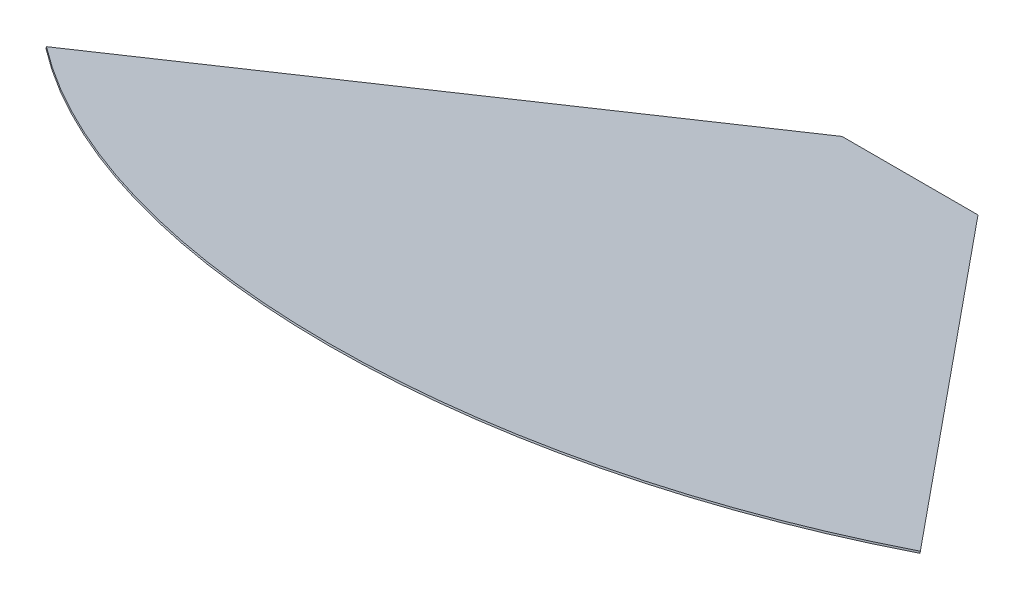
ISO-10303-21;
HEADER;
FILE_DESCRIPTION(('STEP AP214'),'2;1');
FILE_NAME('part.step','',(''),(''),'','','');
FILE_SCHEMA(('AUTOMOTIVE_DESIGN { 1 0 10303 214 1 1 1 1 }'));
ENDSEC;
DATA;
#1=APPLICATION_CONTEXT('core data for automotive mechanical design processes');
#2=APPLICATION_PROTOCOL_DEFINITION('international standard','automotive_design',2000,#1);
#3=PRODUCT_CONTEXT('',#1,'mechanical');
#4=PRODUCT('Part','Part','',(#3));
#5=PRODUCT_RELATED_PRODUCT_CATEGORY('part','',(#4));
#6=PRODUCT_DEFINITION_FORMATION('','',#4);
#7=PRODUCT_DEFINITION_CONTEXT('part definition',#1,'design');
#8=PRODUCT_DEFINITION('design','',#6,#7);
#9=PRODUCT_DEFINITION_SHAPE('','',#8);
#10=(LENGTH_UNIT() NAMED_UNIT(*) SI_UNIT(.MILLI.,.METRE.));
#11=(NAMED_UNIT(*) PLANE_ANGLE_UNIT() SI_UNIT($,.RADIAN.));
#12=(NAMED_UNIT(*) SI_UNIT($,.STERADIAN.) SOLID_ANGLE_UNIT());
#13=UNCERTAINTY_MEASURE_WITH_UNIT(LENGTH_MEASURE(1.E-05),#10,'distance_accuracy_value','');
#14=(GEOMETRIC_REPRESENTATION_CONTEXT(3) GLOBAL_UNCERTAINTY_ASSIGNED_CONTEXT((#13)) GLOBAL_UNIT_ASSIGNED_CONTEXT((#10,
#11,#12)) REPRESENTATION_CONTEXT('',''));
#15=CARTESIAN_POINT('',(0.,0.,0.));
#16=DIRECTION('',(0.,0.,1.));
#17=DIRECTION('',(1.,0.,0.));
#18=AXIS2_PLACEMENT_3D('',#15,#16,#17);
#19=CARTESIAN_POINT('',(-53.47992912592,5.949372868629,71.03587242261));
#20=DIRECTION('',(0.,0.970189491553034,-0.242347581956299));
#21=DIRECTION('',(0.,0.242347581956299,0.970189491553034));
#22=AXIS2_PLACEMENT_3D('',#19,#20,#21);
#23=PLANE('',#22);
#24=DIRECTION('',(1.,0.,0.));
#25=VECTOR('',#24,1.);
#26=CARTESIAN_POINT('',(0.,6.29104310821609,72.4036800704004));
#27=LINE('',#26,#25);
#28=CARTESIAN_POINT('',(8.00000000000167,6.29104310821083,72.4036800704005));
#29=VERTEX_POINT('',#28);
#30=CARTESIAN_POINT('',(-8.,6.29104310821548,72.4036800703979));
#31=VERTEX_POINT('',#30);
#32=EDGE_CURVE('E57',#29,#31,#27,.F.);
#33=ORIENTED_EDGE('',*,*,#32,.T.);
#34=DIRECTION('',(-0.642787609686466,0.18564901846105,0.743208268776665));
#35=VECTOR('',#34,1.);
#36=CARTESIAN_POINT('',(-29.711504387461,12.5617294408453,97.5071035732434));
#37=LINE('',#36,#35);
#38=CARTESIAN_POINT('',(-51.4230087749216,18.8324157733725,122.61052707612));
#39=VERTEX_POINT('',#38);
#40=EDGE_CURVE('E51',#31,#39,#37,.T.);
#41=ORIENTED_EDGE('',*,*,#40,.T.);
#42=CARTESIAN_POINT('',(0.,3.98049429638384,63.1538655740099));
#43=DIRECTION('',(0.,0.970189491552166,-0.242347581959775));
#44=DIRECTION('',(0.,0.242347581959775,0.970189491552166));
#45=AXIS2_PLACEMENT_3D('',#42,#43,#44);
#46=CIRCLE('',#45,80.0000000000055);
#47=CARTESIAN_POINT('',(51.4230087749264,18.8324157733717,122.610527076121));
#48=VERTEX_POINT('',#47);
#49=EDGE_CURVE('E20',#39,#48,#46,.T.);
#50=ORIENTED_EDGE('',*,*,#49,.T.);
#51=DIRECTION('',(0.642787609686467,0.18564901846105,0.743208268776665));
#52=VECTOR('',#51,1.);
#53=CARTESIAN_POINT('',(29.711504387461,12.5617294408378,97.5071035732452));
#54=LINE('',#53,#52);
#55=EDGE_CURVE('E74',#48,#29,#54,.F.);
#56=ORIENTED_EDGE('',*,*,#55,.T.);
#57=EDGE_LOOP('',(#33,#41,#50,#56));
#58=FACE_BOUND('',#57,.T.);
#59=ADVANCED_FACE('F16',(#58),#23,.T.);
#60=CARTESIAN_POINT('',(8.32,5.951843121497,72.48841021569));
#61=DIRECTION('',(0.,-0.242347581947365,-0.970189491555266));
#62=DIRECTION('',(-1.,0.,0.));
#63=AXIS2_PLACEMENT_3D('',#60,#61,#62);
#64=PLANE('',#63);
#65=DIRECTION('',(-1.,0.,0.));
#66=VECTOR('',#65,1.);
#67=CARTESIAN_POINT('',(0.,6.09700520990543,72.4521495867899));
#68=LINE('',#67,#66);
#69=CARTESIAN_POINT('',(8.00000000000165,6.09700520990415,72.4521495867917));
#70=VERTEX_POINT('',#69);
#71=CARTESIAN_POINT('',(-7.99999999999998,6.09700520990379,72.4521495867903));
#72=VERTEX_POINT('',#71);
#73=EDGE_CURVE('E66',#70,#72,#68,.T.);
#74=ORIENTED_EDGE('',*,*,#73,.T.);
#75=DIRECTION('',(0.,0.970189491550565,-0.242347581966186));
#76=VECTOR('',#75,1.);
#77=CARTESIAN_POINT('',(-8.,6.19402415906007,72.4279148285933));
#78=LINE('',#77,#76);
#79=EDGE_CURVE('E152',#72,#31,#78,.T.);
#80=ORIENTED_EDGE('',*,*,#79,.T.);
#81=ORIENTED_EDGE('',*,*,#32,.F.);
#82=DIRECTION('',(0.,0.970189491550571,-0.24234758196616));
#83=VECTOR('',#82,1.);
#84=CARTESIAN_POINT('',(8.00000000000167,6.19402415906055,72.4279148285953));
#85=LINE('',#84,#83);
#86=EDGE_CURVE('E71',#29,#70,#85,.F.);
#87=ORIENTED_EDGE('',*,*,#86,.T.);
#88=EDGE_LOOP('',(#74,#80,#81,#87));
#89=FACE_BOUND('',#88,.T.);
#90=ADVANCED_FACE('F73',(#89),#64,.T.);
#91=CARTESIAN_POINT('',(-52.29146895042,18.74404324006,123.6993941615));
#92=DIRECTION('',(0.766044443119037,0.155778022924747,0.623625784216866));
#93=DIRECTION('',(0.642787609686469,-0.185649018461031,-0.743208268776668));
#94=AXIS2_PLACEMENT_3D('',#91,#92,#93);
#95=PLANE('',#94);
#96=ORIENTED_EDGE('',*,*,#40,.F.);
#97=ORIENTED_EDGE('',*,*,#79,.F.);
#98=DIRECTION('',(0.642787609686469,-0.185649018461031,-0.743208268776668));
#99=VECTOR('',#98,1.);
#100=CARTESIAN_POINT('',(-52.2914689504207,18.8892053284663,123.663133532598));
#101=LINE('',#100,#99);
#102=CARTESIAN_POINT('',(-51.4230087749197,18.6383778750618,122.658996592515));
#103=VERTEX_POINT('',#102);
#104=EDGE_CURVE('E70',#72,#103,#101,.F.);
#105=ORIENTED_EDGE('',*,*,#104,.T.);
#106=DIRECTION('',(6.81040222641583E-12,0.97018949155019,-0.242347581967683));
#107=VECTOR('',#106,1.);
#108=CARTESIAN_POINT('',(-51.423008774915,18.7353968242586,122.634761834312));
#109=LINE('',#108,#107);
#110=EDGE_CURVE('E153',#103,#39,#109,.T.);
#111=ORIENTED_EDGE('',*,*,#110,.T.);
#112=EDGE_LOOP('',(#96,#97,#105,#111));
#113=FACE_BOUND('',#112,.T.);
#114=ADVANCED_FACE('F84',(#113),#95,.F.);
#115=CARTESIAN_POINT('',(0.,3.78645639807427,63.2023350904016));
#116=DIRECTION('',(0.,0.970189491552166,-0.242347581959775));
#117=DIRECTION('',(0.,0.242347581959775,0.970189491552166));
#118=AXIS2_PLACEMENT_3D('',#115,#116,#117);
#119=CYLINDRICAL_SURFACE('',#118,80.0000000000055);
#120=ORIENTED_EDGE('',*,*,#49,.F.);
#121=ORIENTED_EDGE('',*,*,#110,.F.);
#122=CARTESIAN_POINT('',(0.,3.78645639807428,63.2023350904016));
#123=DIRECTION('',(0.,0.970189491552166,-0.242347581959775));
#124=DIRECTION('',(0.,0.242347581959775,0.970189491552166));
#125=AXIS2_PLACEMENT_3D('',#122,#123,#124);
#126=CIRCLE('',#125,80.0000000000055);
#127=CARTESIAN_POINT('',(51.4230087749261,18.6383778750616,122.658996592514));
#128=VERTEX_POINT('',#127);
#129=EDGE_CURVE('E26',#103,#128,#126,.T.);
#130=ORIENTED_EDGE('',*,*,#129,.T.);
#131=DIRECTION('',(0.,-0.970189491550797,0.242347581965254));
#132=VECTOR('',#131,1.);
#133=CARTESIAN_POINT('',(51.4230087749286,18.7353968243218,122.634761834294));
#134=LINE('',#133,#132);
#135=EDGE_CURVE('E34',#128,#48,#134,.F.);
#136=ORIENTED_EDGE('',*,*,#135,.T.);
#137=EDGE_LOOP('',(#120,#121,#130,#136));
#138=FACE_BOUND('',#137,.T.);
#139=ADVANCED_FACE('F78',(#138),#119,.T.);
#140=CARTESIAN_POINT('',(52.29146895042,18.74404324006,123.6993941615));
#141=DIRECTION('',(0.766044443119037,-0.155778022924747,-0.623625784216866));
#142=DIRECTION('',(-0.642787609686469,-0.185649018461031,-0.743208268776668));
#143=AXIS2_PLACEMENT_3D('',#140,#141,#142);
#144=PLANE('',#143);
#145=ORIENTED_EDGE('',*,*,#55,.F.);
#146=ORIENTED_EDGE('',*,*,#135,.F.);
#147=DIRECTION('',(-0.642787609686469,-0.185649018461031,-0.743208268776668));
#148=VECTOR('',#147,1.);
#149=CARTESIAN_POINT('',(52.2914689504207,18.8892053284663,123.663133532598));
#150=LINE('',#149,#148);
#151=EDGE_CURVE('E11',#128,#70,#150,.T.);
#152=ORIENTED_EDGE('',*,*,#151,.T.);
#153=ORIENTED_EDGE('',*,*,#86,.F.);
#154=EDGE_LOOP('',(#145,#146,#152,#153));
#155=FACE_BOUND('',#154,.T.);
#156=ADVANCED_FACE('F76',(#155),#144,.T.);
#157=CARTESIAN_POINT('',(-53.47992912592,5.755334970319,71.084341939));
#158=DIRECTION('',(0.,0.970189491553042,-0.242347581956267));
#159=DIRECTION('',(0.,0.242347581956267,0.970189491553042));
#160=AXIS2_PLACEMENT_3D('',#157,#158,#159);
#161=PLANE('',#160);
#162=ORIENTED_EDGE('',*,*,#129,.F.);
#163=ORIENTED_EDGE('',*,*,#104,.F.);
#164=ORIENTED_EDGE('',*,*,#73,.F.);
#165=ORIENTED_EDGE('',*,*,#151,.F.);
#166=EDGE_LOOP('',(#162,#163,#164,#165));
#167=FACE_BOUND('',#166,.T.);
#168=ADVANCED_FACE('F18',(#167),#161,.F.);
#169=CLOSED_SHELL('',(#59,#90,#114,#139,#156,#168));
#170=MANIFOLD_SOLID_BREP('B1',#169);
#171=ADVANCED_BREP_SHAPE_REPRESENTATION('',(#18,#170),#14);
#172=SHAPE_DEFINITION_REPRESENTATION(#9,#171);
ENDSEC;
END-ISO-10303-21;
